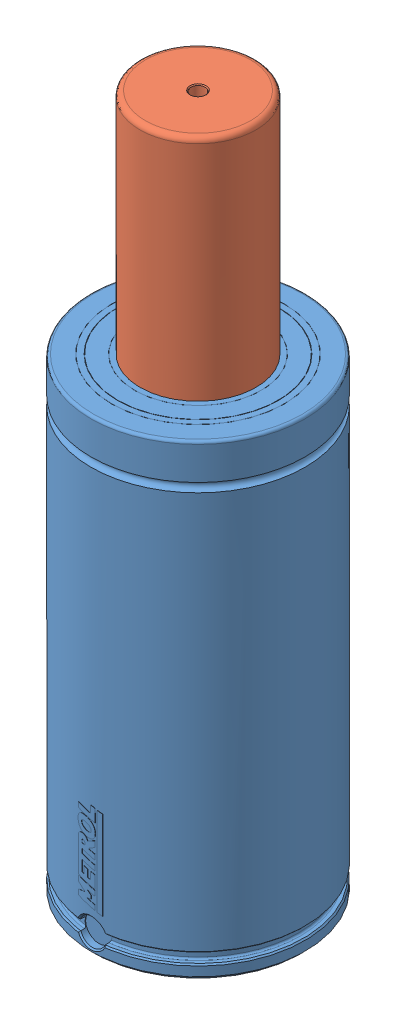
SolidWorks assembly ISNG5000-125.SLDASM, configuration Default (file format 7000). Lengths in mm.
Overall size (120 390 120.11).
2 component instances, 2 part files, 5 mates.
Components (placement in the parent):
- ISNG-5000 Body-1: ISNG-5000 Body.SLDPRT [ISNG-5000-125] x (0 0 1) z (0 -1 0) size (120.11 120 262)
- ISNG-5000 Piston-1: ISNG-5000 Piston.SLDPRT [ISNG-5000-125] at (0 237 0) x (-0.227039 0 0.973886) z (0 -1 0) size (85 85 153)
Mates (geometry in assembly coordinates):
- Concentric1: concentric aligned: cylinder of ISNG-5000 Body-1 through (0 0 0) axis (0 -1 0) radius 32.5; cylinder of ISNG-5000 Piston-1 through (0 237 0) axis (0 -1 0) radius 32.5
- LimitDistance2: limit distance anti-aligned: plane of ISNG-5000 Piston-1 through (-41.3901 242 -9.6492) normal (0 1 0); plane of ISNG-5000 Body-1 through (-32.5 242 0) normal (0 -1 0)
- Coincident1: coincident anti-aligned: plane of ISNG-5000 Body-1 through (0 0 0) normal (0 -1 0); plane of assembly through (0 0 0) normal (0 1 0)
- Coincident2: coincident aligned: plane of ISNG-5000 Body-1; plane of assembly through (0 0 0) normal (0 0 1)
- Coincident3: coincident anti-aligned: plane of ISNG-5000 Body-1; plane of assembly through (0 0 0) normal (1 0 0)
